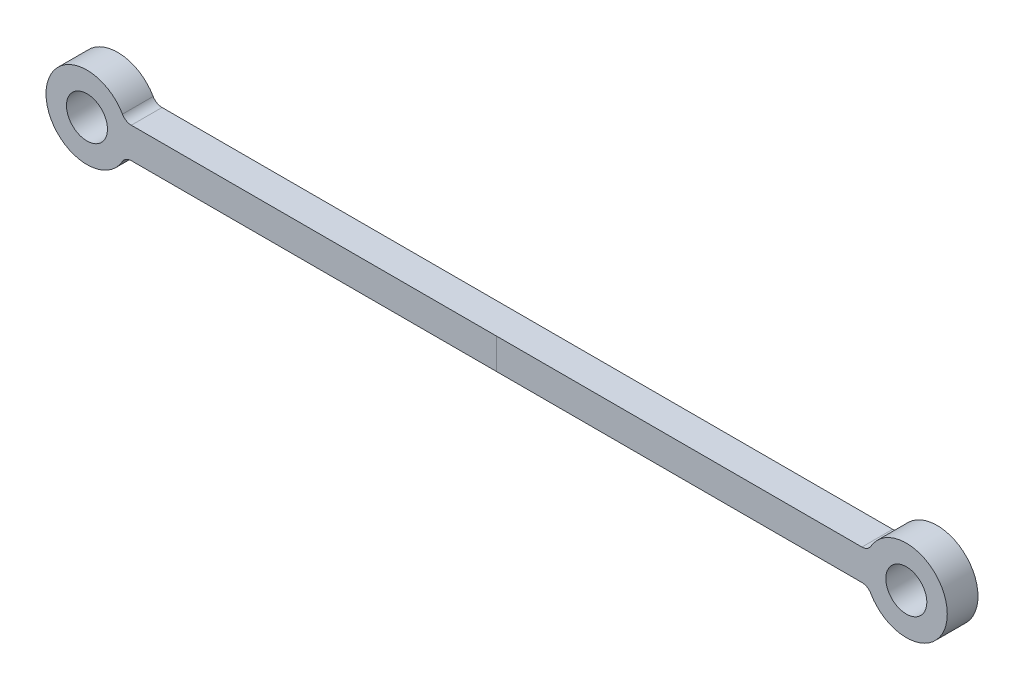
ISO-10303-21;
HEADER;
FILE_DESCRIPTION(('STEP AP214'),'2;1');
FILE_NAME('part.step','',(''),(''),'','','');
FILE_SCHEMA(('AUTOMOTIVE_DESIGN { 1 0 10303 214 1 1 1 1 }'));
ENDSEC;
DATA;
#1=APPLICATION_CONTEXT('core data for automotive mechanical design processes');
#2=APPLICATION_PROTOCOL_DEFINITION('international standard','automotive_design',2000,#1);
#3=PRODUCT_CONTEXT('',#1,'mechanical');
#4=PRODUCT('Part','Part','',(#3));
#5=PRODUCT_RELATED_PRODUCT_CATEGORY('part','',(#4));
#6=PRODUCT_DEFINITION_FORMATION('','',#4);
#7=PRODUCT_DEFINITION_CONTEXT('part definition',#1,'design');
#8=PRODUCT_DEFINITION('design','',#6,#7);
#9=PRODUCT_DEFINITION_SHAPE('','',#8);
#10=(LENGTH_UNIT() NAMED_UNIT(*) SI_UNIT(.MILLI.,.METRE.));
#11=(NAMED_UNIT(*) PLANE_ANGLE_UNIT() SI_UNIT($,.RADIAN.));
#12=(NAMED_UNIT(*) SI_UNIT($,.STERADIAN.) SOLID_ANGLE_UNIT());
#13=UNCERTAINTY_MEASURE_WITH_UNIT(LENGTH_MEASURE(1.E-05),#10,'distance_accuracy_value','');
#14=(GEOMETRIC_REPRESENTATION_CONTEXT(3) GLOBAL_UNCERTAINTY_ASSIGNED_CONTEXT((#13)) GLOBAL_UNIT_ASSIGNED_CONTEXT((#10,
#11,#12)) REPRESENTATION_CONTEXT('',''));
#15=CARTESIAN_POINT('',(0.,0.,0.));
#16=DIRECTION('',(0.,0.,1.));
#17=DIRECTION('',(1.,0.,0.));
#18=AXIS2_PLACEMENT_3D('',#15,#16,#17);
#19=CARTESIAN_POINT('',(-400.,-15.,30.));
#20=DIRECTION('',(0.,0.,1.));
#21=DIRECTION('',(1.,0.,0.));
#22=AXIS2_PLACEMENT_3D('',#19,#20,#21);
#23=PLANE('',#22);
#24=CARTESIAN_POINT('',(-400.,0.,30.));
#25=DIRECTION('',(0.,0.,1.));
#26=DIRECTION('',(1.,0.,0.));
#27=AXIS2_PLACEMENT_3D('',#24,#25,#26);
#28=CIRCLE('',#27,20.);
#29=CARTESIAN_POINT('',(-380.,0.,30.));
#30=VERTEX_POINT('',#29);
#31=EDGE_CURVE('E198',#30,#30,#28,.T.);
#32=ORIENTED_EDGE('',*,*,#31,.F.);
#33=EDGE_LOOP('',(#32));
#34=FACE_BOUND('',#33,.T.);
#35=DIRECTION('',(1.,0.,0.));
#36=VECTOR('',#35,1.);
#37=CARTESIAN_POINT('',(-400.,-15.,30.));
#38=LINE('',#37,#36);
#39=CARTESIAN_POINT('',(-356.698729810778,-15.,30.));
#40=VERTEX_POINT('',#39);
#41=CARTESIAN_POINT('',(0.,-15.,30.));
#42=VERTEX_POINT('',#41);
#43=EDGE_CURVE('E110',#40,#42,#38,.T.);
#44=ORIENTED_EDGE('',*,*,#43,.T.);
#45=DIRECTION('',(0.,1.,0.));
#46=VECTOR('',#45,1.);
#47=CARTESIAN_POINT('',(0.,-15.,30.));
#48=LINE('',#47,#46);
#49=CARTESIAN_POINT('',(0.,15.,30.));
#50=VERTEX_POINT('',#49);
#51=EDGE_CURVE('E11',#42,#50,#48,.T.);
#52=ORIENTED_EDGE('',*,*,#51,.T.);
#53=DIRECTION('',(-1.,0.,0.));
#54=VECTOR('',#53,1.);
#55=CARTESIAN_POINT('',(-400.,15.,30.));
#56=LINE('',#55,#54);
#57=CARTESIAN_POINT('',(-356.698729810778,15.,30.));
#58=VERTEX_POINT('',#57);
#59=EDGE_CURVE('E127',#50,#58,#56,.T.);
#60=ORIENTED_EDGE('',*,*,#59,.T.);
#61=CARTESIAN_POINT('',(-356.698729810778,25.,30.));
#62=DIRECTION('',(0.,0.,1.));
#63=DIRECTION('',(1.,0.,0.));
#64=AXIS2_PLACEMENT_3D('',#61,#62,#63);
#65=CIRCLE('',#64,10.);
#66=CARTESIAN_POINT('',(-365.358983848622,20.,30.));
#67=VERTEX_POINT('',#66);
#68=EDGE_CURVE('E116',#58,#67,#65,.F.);
#69=ORIENTED_EDGE('',*,*,#68,.T.);
#70=CARTESIAN_POINT('',(-400.,0.,30.));
#71=DIRECTION('',(0.,0.,1.));
#72=DIRECTION('',(1.,0.,0.));
#73=AXIS2_PLACEMENT_3D('',#70,#71,#72);
#74=CIRCLE('',#73,40.);
#75=CARTESIAN_POINT('',(-365.358983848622,-20.,30.));
#76=VERTEX_POINT('',#75);
#77=EDGE_CURVE('E112',#67,#76,#74,.T.);
#78=ORIENTED_EDGE('',*,*,#77,.T.);
#79=CARTESIAN_POINT('',(-356.698729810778,-25.,30.));
#80=DIRECTION('',(0.,0.,1.));
#81=DIRECTION('',(1.,0.,0.));
#82=AXIS2_PLACEMENT_3D('',#79,#80,#81);
#83=CIRCLE('',#82,10.);
#84=EDGE_CURVE('E108',#76,#40,#83,.F.);
#85=ORIENTED_EDGE('',*,*,#84,.T.);
#86=EDGE_LOOP('',(#44,#52,#60,#69,#78,#85));
#87=FACE_BOUND('',#86,.T.);
#88=ADVANCED_FACE('F34',(#34,#87),#23,.T.);
#89=CARTESIAN_POINT('',(-400.,-15.,0.));
#90=DIRECTION('',(0.,0.,1.));
#91=DIRECTION('',(1.,0.,0.));
#92=AXIS2_PLACEMENT_3D('',#89,#90,#91);
#93=PLANE('',#92);
#94=CARTESIAN_POINT('',(-400.,0.,0.));
#95=DIRECTION('',(0.,0.,1.));
#96=DIRECTION('',(1.,0.,0.));
#97=AXIS2_PLACEMENT_3D('',#94,#95,#96);
#98=CIRCLE('',#97,20.);
#99=CARTESIAN_POINT('',(-380.,0.,0.));
#100=VERTEX_POINT('',#99);
#101=EDGE_CURVE('E196',#100,#100,#98,.T.);
#102=ORIENTED_EDGE('',*,*,#101,.T.);
#103=EDGE_LOOP('',(#102));
#104=FACE_BOUND('',#103,.T.);
#105=DIRECTION('',(0.,1.,0.));
#106=VECTOR('',#105,1.);
#107=CARTESIAN_POINT('',(0.,-15.,0.));
#108=LINE('',#107,#106);
#109=CARTESIAN_POINT('',(0.,-15.,0.));
#110=VERTEX_POINT('',#109);
#111=CARTESIAN_POINT('',(0.,15.,0.));
#112=VERTEX_POINT('',#111);
#113=EDGE_CURVE('E38',#110,#112,#108,.T.);
#114=ORIENTED_EDGE('',*,*,#113,.F.);
#115=DIRECTION('',(1.,0.,0.));
#116=VECTOR('',#115,1.);
#117=CARTESIAN_POINT('',(-400.,-15.,0.));
#118=LINE('',#117,#116);
#119=CARTESIAN_POINT('',(-356.698729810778,-15.,0.));
#120=VERTEX_POINT('',#119);
#121=EDGE_CURVE('E188',#120,#110,#118,.T.);
#122=ORIENTED_EDGE('',*,*,#121,.F.);
#123=CARTESIAN_POINT('',(-356.698729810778,-25.,0.));
#124=DIRECTION('',(0.,0.,1.));
#125=DIRECTION('',(1.,0.,0.));
#126=AXIS2_PLACEMENT_3D('',#123,#124,#125);
#127=CIRCLE('',#126,10.);
#128=CARTESIAN_POINT('',(-365.358983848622,-20.,0.));
#129=VERTEX_POINT('',#128);
#130=EDGE_CURVE('E117',#120,#129,#127,.T.);
#131=ORIENTED_EDGE('',*,*,#130,.T.);
#132=CARTESIAN_POINT('',(-400.,0.,0.));
#133=DIRECTION('',(0.,0.,1.));
#134=DIRECTION('',(1.,0.,0.));
#135=AXIS2_PLACEMENT_3D('',#132,#133,#134);
#136=CIRCLE('',#135,40.);
#137=CARTESIAN_POINT('',(-365.358983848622,20.,0.));
#138=VERTEX_POINT('',#137);
#139=EDGE_CURVE('E193',#129,#138,#136,.F.);
#140=ORIENTED_EDGE('',*,*,#139,.T.);
#141=CARTESIAN_POINT('',(-356.698729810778,25.,0.));
#142=DIRECTION('',(0.,0.,1.));
#143=DIRECTION('',(1.,0.,0.));
#144=AXIS2_PLACEMENT_3D('',#141,#142,#143);
#145=CIRCLE('',#144,10.);
#146=CARTESIAN_POINT('',(-356.698729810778,15.,0.));
#147=VERTEX_POINT('',#146);
#148=EDGE_CURVE('E146',#138,#147,#145,.T.);
#149=ORIENTED_EDGE('',*,*,#148,.T.);
#150=DIRECTION('',(-1.,0.,0.));
#151=VECTOR('',#150,1.);
#152=CARTESIAN_POINT('',(-400.,15.,0.));
#153=LINE('',#152,#151);
#154=EDGE_CURVE('E182',#112,#147,#153,.T.);
#155=ORIENTED_EDGE('',*,*,#154,.F.);
#156=EDGE_LOOP('',(#114,#122,#131,#140,#149,#155));
#157=FACE_BOUND('',#156,.T.);
#158=ADVANCED_FACE('F183',(#104,#157),#93,.F.);
#159=ORIENTED_EDGE('',*,*,#51,.F.);
#160=CARTESIAN_POINT('',(356.698729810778,-15.,30.));
#161=VERTEX_POINT('',#160);
#162=EDGE_CURVE('E126',#42,#161,#38,.T.);
#163=ORIENTED_EDGE('',*,*,#162,.T.);
#164=CARTESIAN_POINT('',(356.698729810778,-25.,30.));
#165=DIRECTION('',(0.,0.,1.));
#166=DIRECTION('',(1.,0.,0.));
#167=AXIS2_PLACEMENT_3D('',#164,#165,#166);
#168=CIRCLE('',#167,10.);
#169=CARTESIAN_POINT('',(365.358983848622,-20.,30.));
#170=VERTEX_POINT('',#169);
#171=EDGE_CURVE('E162',#161,#170,#168,.F.);
#172=ORIENTED_EDGE('',*,*,#171,.T.);
#173=CARTESIAN_POINT('',(400.,0.,30.));
#174=DIRECTION('',(0.,0.,-1.));
#175=DIRECTION('',(-1.,0.,0.));
#176=AXIS2_PLACEMENT_3D('',#173,#174,#175);
#177=CIRCLE('',#176,40.);
#178=CARTESIAN_POINT('',(365.358983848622,20.,30.));
#179=VERTEX_POINT('',#178);
#180=EDGE_CURVE('E205',#179,#170,#177,.T.);
#181=ORIENTED_EDGE('',*,*,#180,.F.);
#182=CARTESIAN_POINT('',(356.698729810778,25.,30.));
#183=DIRECTION('',(0.,0.,1.));
#184=DIRECTION('',(1.,0.,0.));
#185=AXIS2_PLACEMENT_3D('',#182,#183,#184);
#186=CIRCLE('',#185,10.);
#187=CARTESIAN_POINT('',(356.698729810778,15.,30.));
#188=VERTEX_POINT('',#187);
#189=EDGE_CURVE('E164',#179,#188,#186,.F.);
#190=ORIENTED_EDGE('',*,*,#189,.T.);
#191=EDGE_CURVE('E131',#188,#50,#56,.T.);
#192=ORIENTED_EDGE('',*,*,#191,.T.);
#193=EDGE_LOOP('',(#159,#163,#172,#181,#190,#192));
#194=FACE_BOUND('',#193,.T.);
#195=CARTESIAN_POINT('',(400.,0.,30.));
#196=DIRECTION('',(0.,0.,-1.));
#197=DIRECTION('',(-1.,0.,0.));
#198=AXIS2_PLACEMENT_3D('',#195,#196,#197);
#199=CIRCLE('',#198,20.);
#200=CARTESIAN_POINT('',(380.,0.,30.));
#201=VERTEX_POINT('',#200);
#202=EDGE_CURVE('E209',#201,#201,#199,.T.);
#203=ORIENTED_EDGE('',*,*,#202,.T.);
#204=EDGE_LOOP('',(#203));
#205=FACE_BOUND('',#204,.T.);
#206=ADVANCED_FACE('F218',(#194,#205),#23,.T.);
#207=CARTESIAN_POINT('',(356.698729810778,-15.,0.));
#208=VERTEX_POINT('',#207);
#209=EDGE_CURVE('E180',#110,#208,#118,.T.);
#210=ORIENTED_EDGE('',*,*,#209,.F.);
#211=ORIENTED_EDGE('',*,*,#113,.T.);
#212=CARTESIAN_POINT('',(356.698729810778,15.,0.));
#213=VERTEX_POINT('',#212);
#214=EDGE_CURVE('E137',#213,#112,#153,.T.);
#215=ORIENTED_EDGE('',*,*,#214,.F.);
#216=CARTESIAN_POINT('',(356.698729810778,25.,0.));
#217=DIRECTION('',(0.,0.,1.));
#218=DIRECTION('',(1.,0.,0.));
#219=AXIS2_PLACEMENT_3D('',#216,#217,#218);
#220=CIRCLE('',#219,10.);
#221=CARTESIAN_POINT('',(365.358983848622,20.,0.));
#222=VERTEX_POINT('',#221);
#223=EDGE_CURVE('E166',#213,#222,#220,.T.);
#224=ORIENTED_EDGE('',*,*,#223,.T.);
#225=CARTESIAN_POINT('',(400.,0.,0.));
#226=DIRECTION('',(0.,0.,1.));
#227=DIRECTION('',(1.,0.,0.));
#228=AXIS2_PLACEMENT_3D('',#225,#226,#227);
#229=CIRCLE('',#228,40.);
#230=CARTESIAN_POINT('',(365.358983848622,-20.,0.));
#231=VERTEX_POINT('',#230);
#232=EDGE_CURVE('E202',#231,#222,#229,.T.);
#233=ORIENTED_EDGE('',*,*,#232,.F.);
#234=CARTESIAN_POINT('',(356.698729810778,-25.,0.));
#235=DIRECTION('',(0.,0.,1.));
#236=DIRECTION('',(1.,0.,0.));
#237=AXIS2_PLACEMENT_3D('',#234,#235,#236);
#238=CIRCLE('',#237,10.);
#239=EDGE_CURVE('E159',#231,#208,#238,.T.);
#240=ORIENTED_EDGE('',*,*,#239,.T.);
#241=EDGE_LOOP('',(#210,#211,#215,#224,#233,#240));
#242=FACE_BOUND('',#241,.T.);
#243=CARTESIAN_POINT('',(400.,0.,0.));
#244=DIRECTION('',(0.,0.,-1.));
#245=DIRECTION('',(-1.,0.,0.));
#246=AXIS2_PLACEMENT_3D('',#243,#244,#245);
#247=CIRCLE('',#246,20.);
#248=CARTESIAN_POINT('',(380.,0.,0.));
#249=VERTEX_POINT('',#248);
#250=EDGE_CURVE('E208',#249,#249,#247,.T.);
#251=ORIENTED_EDGE('',*,*,#250,.F.);
#252=EDGE_LOOP('',(#251));
#253=FACE_BOUND('',#252,.T.);
#254=ADVANCED_FACE('F177',(#242,#253),#93,.F.);
#255=CARTESIAN_POINT('',(-400.,-15.,30.));
#256=DIRECTION('',(0.,1.,0.));
#257=DIRECTION('',(0.,0.,1.));
#258=AXIS2_PLACEMENT_3D('',#255,#256,#257);
#259=PLANE('',#258);
#260=ORIENTED_EDGE('',*,*,#121,.T.);
#261=ORIENTED_EDGE('',*,*,#209,.T.);
#262=DIRECTION('',(0.,0.,-1.));
#263=VECTOR('',#262,1.);
#264=CARTESIAN_POINT('',(356.698729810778,-15.,30.));
#265=LINE('',#264,#263);
#266=EDGE_CURVE('E155',#208,#161,#265,.F.);
#267=ORIENTED_EDGE('',*,*,#266,.T.);
#268=ORIENTED_EDGE('',*,*,#162,.F.);
#269=ORIENTED_EDGE('',*,*,#43,.F.);
#270=DIRECTION('',(0.,0.,1.));
#271=VECTOR('',#270,1.);
#272=CARTESIAN_POINT('',(-356.698729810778,-15.,30.));
#273=LINE('',#272,#271);
#274=EDGE_CURVE('E123',#40,#120,#273,.F.);
#275=ORIENTED_EDGE('',*,*,#274,.T.);
#276=EDGE_LOOP('',(#260,#261,#267,#268,#269,#275));
#277=FACE_BOUND('',#276,.T.);
#278=ADVANCED_FACE('F122',(#277),#259,.F.);
#279=CARTESIAN_POINT('',(-400.,15.,30.));
#280=DIRECTION('',(0.,-1.,0.));
#281=DIRECTION('',(0.,0.,-1.));
#282=AXIS2_PLACEMENT_3D('',#279,#280,#281);
#283=PLANE('',#282);
#284=ORIENTED_EDGE('',*,*,#191,.F.);
#285=DIRECTION('',(0.,0.,-1.));
#286=VECTOR('',#285,1.);
#287=CARTESIAN_POINT('',(356.698729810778,15.,0.));
#288=LINE('',#287,#286);
#289=EDGE_CURVE('E157',#188,#213,#288,.T.);
#290=ORIENTED_EDGE('',*,*,#289,.T.);
#291=ORIENTED_EDGE('',*,*,#214,.T.);
#292=ORIENTED_EDGE('',*,*,#154,.T.);
#293=DIRECTION('',(0.,0.,1.));
#294=VECTOR('',#293,1.);
#295=CARTESIAN_POINT('',(-356.698729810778,15.,30.));
#296=LINE('',#295,#294);
#297=EDGE_CURVE('E141',#147,#58,#296,.T.);
#298=ORIENTED_EDGE('',*,*,#297,.T.);
#299=ORIENTED_EDGE('',*,*,#59,.F.);
#300=EDGE_LOOP('',(#284,#290,#291,#292,#298,#299));
#301=FACE_BOUND('',#300,.T.);
#302=ADVANCED_FACE('F190',(#301),#283,.F.);
#303=CARTESIAN_POINT('',(-400.,0.,-113.137084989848));
#304=DIRECTION('',(0.,0.,1.));
#305=DIRECTION('',(1.,0.,0.));
#306=AXIS2_PLACEMENT_3D('',#303,#304,#305);
#307=CYLINDRICAL_SURFACE('',#306,40.);
#308=ORIENTED_EDGE('',*,*,#139,.F.);
#309=DIRECTION('',(0.,0.,1.));
#310=VECTOR('',#309,1.);
#311=CARTESIAN_POINT('',(-365.358983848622,-20.,-113.137084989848));
#312=LINE('',#311,#310);
#313=EDGE_CURVE('E133',#129,#76,#312,.T.);
#314=ORIENTED_EDGE('',*,*,#313,.T.);
#315=ORIENTED_EDGE('',*,*,#77,.F.);
#316=DIRECTION('',(0.,0.,1.));
#317=VECTOR('',#316,1.);
#318=CARTESIAN_POINT('',(-365.358983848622,20.,-113.137084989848));
#319=LINE('',#318,#317);
#320=EDGE_CURVE('E130',#67,#138,#319,.F.);
#321=ORIENTED_EDGE('',*,*,#320,.T.);
#322=EDGE_LOOP('',(#308,#314,#315,#321));
#323=FACE_BOUND('',#322,.T.);
#324=ADVANCED_FACE('F235',(#323),#307,.T.);
#325=CARTESIAN_POINT('',(-400.,0.,0.));
#326=DIRECTION('',(0.,0.,1.));
#327=DIRECTION('',(1.,0.,0.));
#328=AXIS2_PLACEMENT_3D('',#325,#326,#327);
#329=CYLINDRICAL_SURFACE('',#328,20.);
#330=ORIENTED_EDGE('',*,*,#101,.F.);
#331=EDGE_LOOP('',(#330));
#332=FACE_BOUND('',#331,.T.);
#333=ORIENTED_EDGE('',*,*,#31,.T.);
#334=EDGE_LOOP('',(#333));
#335=FACE_BOUND('',#334,.T.);
#336=ADVANCED_FACE('F238',(#332,#335),#329,.F.);
#337=CARTESIAN_POINT('',(-356.698729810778,-25.,-113.137084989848));
#338=DIRECTION('',(0.,0.,1.));
#339=DIRECTION('',(1.,0.,0.));
#340=AXIS2_PLACEMENT_3D('',#337,#338,#339);
#341=CYLINDRICAL_SURFACE('',#340,10.);
#342=ORIENTED_EDGE('',*,*,#84,.F.);
#343=ORIENTED_EDGE('',*,*,#313,.F.);
#344=ORIENTED_EDGE('',*,*,#130,.F.);
#345=ORIENTED_EDGE('',*,*,#274,.F.);
#346=EDGE_LOOP('',(#342,#343,#344,#345));
#347=FACE_BOUND('',#346,.T.);
#348=ADVANCED_FACE('F129',(#347),#341,.F.);
#349=CARTESIAN_POINT('',(-356.698729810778,25.,-113.137084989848));
#350=DIRECTION('',(0.,0.,1.));
#351=DIRECTION('',(1.,0.,0.));
#352=AXIS2_PLACEMENT_3D('',#349,#350,#351);
#353=CYLINDRICAL_SURFACE('',#352,10.);
#354=ORIENTED_EDGE('',*,*,#148,.F.);
#355=ORIENTED_EDGE('',*,*,#320,.F.);
#356=ORIENTED_EDGE('',*,*,#68,.F.);
#357=ORIENTED_EDGE('',*,*,#297,.F.);
#358=EDGE_LOOP('',(#354,#355,#356,#357));
#359=FACE_BOUND('',#358,.T.);
#360=ADVANCED_FACE('F246',(#359),#353,.F.);
#361=CARTESIAN_POINT('',(400.,0.,-113.137084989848));
#362=DIRECTION('',(0.,0.,1.));
#363=DIRECTION('',(1.,0.,0.));
#364=AXIS2_PLACEMENT_3D('',#361,#362,#363);
#365=CYLINDRICAL_SURFACE('',#364,40.);
#366=ORIENTED_EDGE('',*,*,#180,.T.);
#367=DIRECTION('',(0.,0.,1.));
#368=VECTOR('',#367,1.);
#369=CARTESIAN_POINT('',(365.358983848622,-20.,-113.137084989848));
#370=LINE('',#369,#368);
#371=EDGE_CURVE('E152',#170,#231,#370,.F.);
#372=ORIENTED_EDGE('',*,*,#371,.T.);
#373=ORIENTED_EDGE('',*,*,#232,.T.);
#374=DIRECTION('',(0.,0.,1.));
#375=VECTOR('',#374,1.);
#376=CARTESIAN_POINT('',(365.358983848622,20.,-113.137084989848));
#377=LINE('',#376,#375);
#378=EDGE_CURVE('E149',#222,#179,#377,.T.);
#379=ORIENTED_EDGE('',*,*,#378,.T.);
#380=EDGE_LOOP('',(#366,#372,#373,#379));
#381=FACE_BOUND('',#380,.T.);
#382=ADVANCED_FACE('F243',(#381),#365,.T.);
#383=CARTESIAN_POINT('',(400.,0.,0.));
#384=DIRECTION('',(0.,0.,1.));
#385=DIRECTION('',(1.,0.,0.));
#386=AXIS2_PLACEMENT_3D('',#383,#384,#385);
#387=CYLINDRICAL_SURFACE('',#386,20.);
#388=ORIENTED_EDGE('',*,*,#250,.T.);
#389=EDGE_LOOP('',(#388));
#390=FACE_BOUND('',#389,.T.);
#391=ORIENTED_EDGE('',*,*,#202,.F.);
#392=EDGE_LOOP('',(#391));
#393=FACE_BOUND('',#392,.T.);
#394=ADVANCED_FACE('F215',(#390,#393),#387,.F.);
#395=CARTESIAN_POINT('',(356.698729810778,-25.,-113.137084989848));
#396=DIRECTION('',(0.,0.,1.));
#397=DIRECTION('',(1.,0.,0.));
#398=AXIS2_PLACEMENT_3D('',#395,#396,#397);
#399=CYLINDRICAL_SURFACE('',#398,10.);
#400=ORIENTED_EDGE('',*,*,#171,.F.);
#401=ORIENTED_EDGE('',*,*,#266,.F.);
#402=ORIENTED_EDGE('',*,*,#239,.F.);
#403=ORIENTED_EDGE('',*,*,#371,.F.);
#404=EDGE_LOOP('',(#400,#401,#402,#403));
#405=FACE_BOUND('',#404,.T.);
#406=ADVANCED_FACE('F249',(#405),#399,.F.);
#407=CARTESIAN_POINT('',(356.698729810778,25.,-113.137084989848));
#408=DIRECTION('',(0.,0.,1.));
#409=DIRECTION('',(1.,0.,0.));
#410=AXIS2_PLACEMENT_3D('',#407,#408,#409);
#411=CYLINDRICAL_SURFACE('',#410,10.);
#412=ORIENTED_EDGE('',*,*,#223,.F.);
#413=ORIENTED_EDGE('',*,*,#289,.F.);
#414=ORIENTED_EDGE('',*,*,#189,.F.);
#415=ORIENTED_EDGE('',*,*,#378,.F.);
#416=EDGE_LOOP('',(#412,#413,#414,#415));
#417=FACE_BOUND('',#416,.T.);
#418=ADVANCED_FACE('F36',(#417),#411,.F.);
#419=CLOSED_SHELL('',(#88,#158,#206,#254,#278,#302,#324,#336,#348,#360,#382,#394,#406,#418));
#420=MANIFOLD_SOLID_BREP('B2',#419);
#421=ADVANCED_BREP_SHAPE_REPRESENTATION('',(#18,#420),#14);
#422=SHAPE_DEFINITION_REPRESENTATION(#9,#421);
ENDSEC;
END-ISO-10303-21;
